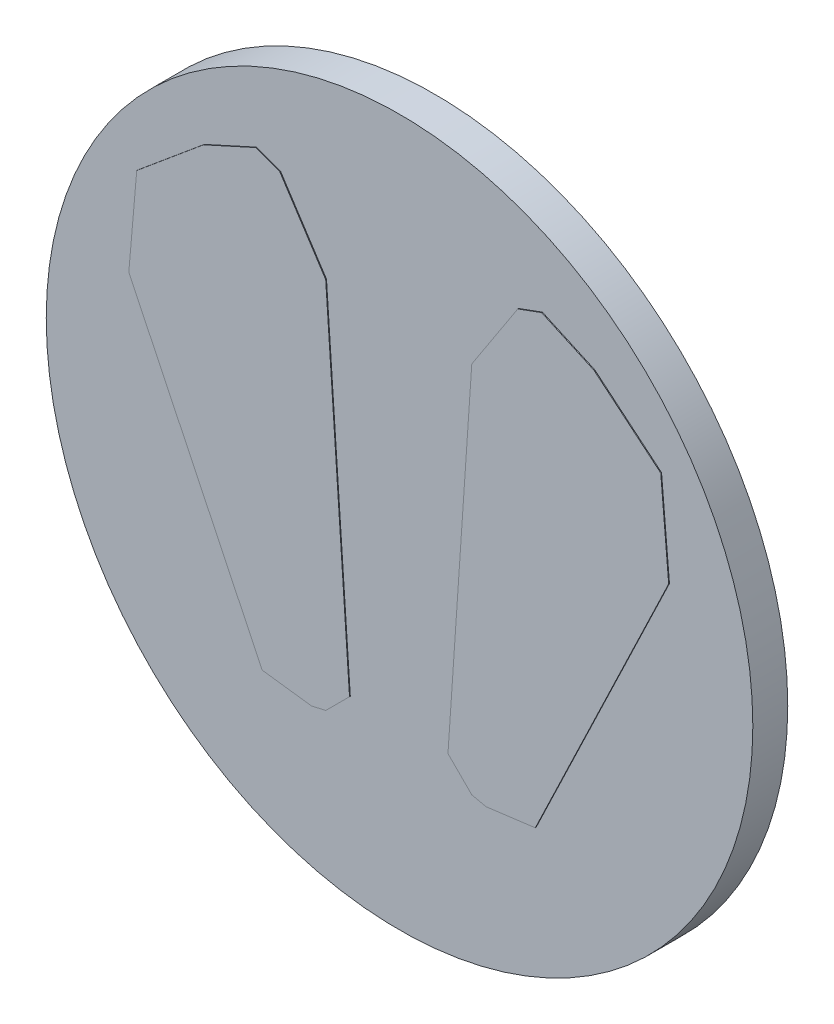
ISO-10303-21;
HEADER;
FILE_DESCRIPTION(('STEP AP214'),'2;1');
FILE_NAME('part.step','',(''),(''),'','','');
FILE_SCHEMA(('AUTOMOTIVE_DESIGN { 1 0 10303 214 1 1 1 1 }'));
ENDSEC;
DATA;
#1=APPLICATION_CONTEXT('core data for automotive mechanical design processes');
#2=APPLICATION_PROTOCOL_DEFINITION('international standard','automotive_design',2000,#1);
#3=PRODUCT_CONTEXT('',#1,'mechanical');
#4=PRODUCT('Part','Part','',(#3));
#5=PRODUCT_RELATED_PRODUCT_CATEGORY('part','',(#4));
#6=PRODUCT_DEFINITION_FORMATION('','',#4);
#7=PRODUCT_DEFINITION_CONTEXT('part definition',#1,'design');
#8=PRODUCT_DEFINITION('design','',#6,#7);
#9=PRODUCT_DEFINITION_SHAPE('','',#8);
#10=(LENGTH_UNIT() NAMED_UNIT(*) SI_UNIT(.MILLI.,.METRE.));
#11=(NAMED_UNIT(*) PLANE_ANGLE_UNIT() SI_UNIT($,.RADIAN.));
#12=(NAMED_UNIT(*) SI_UNIT($,.STERADIAN.) SOLID_ANGLE_UNIT());
#13=UNCERTAINTY_MEASURE_WITH_UNIT(LENGTH_MEASURE(1.E-05),#10,'distance_accuracy_value','');
#14=(GEOMETRIC_REPRESENTATION_CONTEXT(3) GLOBAL_UNCERTAINTY_ASSIGNED_CONTEXT((#13)) GLOBAL_UNIT_ASSIGNED_CONTEXT((#10,
#11,#12)) REPRESENTATION_CONTEXT('',''));
#15=CARTESIAN_POINT('',(0.,0.,0.));
#16=DIRECTION('',(0.,0.,1.));
#17=DIRECTION('',(1.,0.,0.));
#18=AXIS2_PLACEMENT_3D('',#15,#16,#17);
#19=CARTESIAN_POINT('',(0.,0.,22.));
#20=DIRECTION('',(0.,0.,1.));
#21=DIRECTION('',(1.,0.,0.));
#22=AXIS2_PLACEMENT_3D('',#19,#20,#21);
#23=PLANE('',#22);
#24=CARTESIAN_POINT('',(0.,0.,22.));
#25=DIRECTION('',(0.,0.,1.));
#26=DIRECTION('',(1.,0.,0.));
#27=AXIS2_PLACEMENT_3D('',#24,#25,#26);
#28=CIRCLE('',#27,222.5);
#29=CARTESIAN_POINT('',(222.5,0.,22.));
#30=VERTEX_POINT('',#29);
#31=EDGE_CURVE('E11',#30,#30,#28,.T.);
#32=ORIENTED_EDGE('',*,*,#31,.T.);
#33=EDGE_LOOP('',(#32));
#34=FACE_BOUND('',#33,.T.);
#35=DIRECTION('',(0.0680238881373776,0.99768369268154,0.));
#36=VECTOR('',#35,1.);
#37=CARTESIAN_POINT('',(5.12562076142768,-489.990895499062,22.));
#38=LINE('',#37,#36);
#39=CARTESIAN_POINT('',(31.,-110.5,22.));
#40=VERTEX_POINT('',#39);
#41=CARTESIAN_POINT('',(46.,109.5,22.));
#42=VERTEX_POINT('',#41);
#43=EDGE_CURVE('E197',#40,#42,#38,.T.);
#44=ORIENTED_EDGE('',*,*,#43,.T.);
#45=DIRECTION('',(-0.545980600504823,-0.837797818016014,0.));
#46=VECTOR('',#45,1.);
#47=CARTESIAN_POINT('',(-241.772442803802,-332.081851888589,22.));
#48=LINE('',#47,#46);
#49=CARTESIAN_POINT('',(75.0000000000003,154.,22.));
#50=VERTEX_POINT('',#49);
#51=EDGE_CURVE('E210',#50,#42,#48,.T.);
#52=ORIENTED_EDGE('',*,*,#51,.F.);
#53=DIRECTION('',(-0.938876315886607,-0.344254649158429,0.));
#54=VECTOR('',#53,1.);
#55=CARTESIAN_POINT('',(-199.144631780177,53.4803016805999,22.));
#56=LINE('',#55,#54);
#57=CARTESIAN_POINT('',(90.0000000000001,159.5,22.));
#58=VERTEX_POINT('',#57);
#59=EDGE_CURVE('E248',#58,#50,#56,.T.);
#60=ORIENTED_EDGE('',*,*,#59,.F.);
#61=DIRECTION('',(-0.910366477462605,0.413802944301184,0.));
#62=VECTOR('',#61,1.);
#63=CARTESIAN_POINT('',(259.950535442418,82.2497566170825,22.));
#64=LINE('',#63,#62);
#65=CARTESIAN_POINT('',(123.,144.5,22.));
#66=VERTEX_POINT('',#65);
#67=EDGE_CURVE('E246',#66,#58,#64,.T.);
#68=ORIENTED_EDGE('',*,*,#67,.F.);
#69=DIRECTION('',(-0.768221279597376,0.64018439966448,0.));
#70=VECTOR('',#69,1.);
#71=CARTESIAN_POINT('',(362.282666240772,-54.9022218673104,22.));
#72=LINE('',#71,#70);
#73=CARTESIAN_POINT('',(165.,109.5,22.));
#74=VERTEX_POINT('',#73);
#75=EDGE_CURVE('E244',#74,#66,#72,.T.);
#76=ORIENTED_EDGE('',*,*,#75,.F.);
#77=DIRECTION('',(-0.0858883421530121,0.996304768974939,0.));
#78=VECTOR('',#77,1.);
#79=CARTESIAN_POINT('',(215.051936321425,-471.102461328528,22.));
#80=LINE('',#79,#78);
#81=CARTESIAN_POINT('',(170.,51.5000000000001,22.));
#82=VERTEX_POINT('',#81);
#83=EDGE_CURVE('E242',#82,#74,#80,.T.);
#84=ORIENTED_EDGE('',*,*,#83,.F.);
#85=DIRECTION('',(0.432731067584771,0.901523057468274,0.));
#86=VECTOR('',#85,1.);
#87=CARTESIAN_POINT('',(-72.9420369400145,-454.62924362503,22.));
#88=LINE('',#87,#86);
#89=CARTESIAN_POINT('',(86.0000000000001,-123.5,22.));
#90=VERTEX_POINT('',#89);
#91=EDGE_CURVE('E240',#90,#82,#88,.T.);
#92=ORIENTED_EDGE('',*,*,#91,.F.);
#93=DIRECTION('',(-0.991777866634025,-0.127971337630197,0.));
#94=VECTOR('',#93,1.);
#95=CARTESIAN_POINT('',(-45.0619613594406,-140.411220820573,22.));
#96=LINE('',#95,#94);
#97=CARTESIAN_POINT('',(55.,-127.5,22.));
#98=VERTEX_POINT('',#97);
#99=EDGE_CURVE('E237',#90,#98,#96,.T.);
#100=ORIENTED_EDGE('',*,*,#99,.T.);
#101=DIRECTION('',(-0.976187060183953,0.216930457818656,0.));
#102=VECTOR('',#101,1.);
#103=CARTESIAN_POINT('',(79.2770068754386,-132.894890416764,22.));
#104=LINE('',#103,#102);
#105=CARTESIAN_POINT('',(46.,-125.5,22.));
#106=VERTEX_POINT('',#105);
#107=EDGE_CURVE('E234',#98,#106,#104,.T.);
#108=ORIENTED_EDGE('',*,*,#107,.T.);
#109=DIRECTION('',(-0.707106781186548,0.707106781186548,0.));
#110=VECTOR('',#109,1.);
#111=CARTESIAN_POINT('',(205.070710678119,-284.570710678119,22.));
#112=LINE('',#111,#110);
#113=EDGE_CURVE('E200',#106,#40,#112,.T.);
#114=ORIENTED_EDGE('',*,*,#113,.T.);
#115=EDGE_LOOP('',(#44,#52,#60,#68,#76,#84,#92,#100,#108,#114));
#116=FACE_BOUND('',#115,.T.);
#117=DIRECTION('',(-0.0680238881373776,0.99768369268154,0.));
#118=VECTOR('',#117,1.);
#119=CARTESIAN_POINT('',(-5.12562076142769,-489.990895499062,22.));
#120=LINE('',#119,#118);
#121=CARTESIAN_POINT('',(-31.0000000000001,-110.5,22.));
#122=VERTEX_POINT('',#121);
#123=CARTESIAN_POINT('',(-46.,109.5,22.));
#124=VERTEX_POINT('',#123);
#125=EDGE_CURVE('E530',#122,#124,#120,.T.);
#126=ORIENTED_EDGE('',*,*,#125,.F.);
#127=DIRECTION('',(0.707106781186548,0.707106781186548,0.));
#128=VECTOR('',#127,1.);
#129=CARTESIAN_POINT('',(-205.070710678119,-284.570710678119,22.));
#130=LINE('',#129,#128);
#131=CARTESIAN_POINT('',(-46.,-125.5,22.));
#132=VERTEX_POINT('',#131);
#133=EDGE_CURVE('E195',#132,#122,#130,.T.);
#134=ORIENTED_EDGE('',*,*,#133,.F.);
#135=DIRECTION('',(0.976187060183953,0.216930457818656,0.));
#136=VECTOR('',#135,1.);
#137=CARTESIAN_POINT('',(-79.2770068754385,-132.894890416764,22.));
#138=LINE('',#137,#136);
#139=CARTESIAN_POINT('',(-55.,-127.5,22.));
#140=VERTEX_POINT('',#139);
#141=EDGE_CURVE('E191',#140,#132,#138,.T.);
#142=ORIENTED_EDGE('',*,*,#141,.F.);
#143=DIRECTION('',(0.991777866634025,-0.127971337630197,0.));
#144=VECTOR('',#143,1.);
#145=CARTESIAN_POINT('',(45.0619613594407,-140.411220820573,22.));
#146=LINE('',#145,#144);
#147=CARTESIAN_POINT('',(-86.,-123.5,22.));
#148=VERTEX_POINT('',#147);
#149=EDGE_CURVE('E526',#148,#140,#146,.T.);
#150=ORIENTED_EDGE('',*,*,#149,.F.);
#151=DIRECTION('',(-0.432731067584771,0.901523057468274,0.));
#152=VECTOR('',#151,1.);
#153=CARTESIAN_POINT('',(72.9420369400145,-454.62924362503,22.));
#154=LINE('',#153,#152);
#155=CARTESIAN_POINT('',(-170.,51.5,22.));
#156=VERTEX_POINT('',#155);
#157=EDGE_CURVE('E550',#148,#156,#154,.T.);
#158=ORIENTED_EDGE('',*,*,#157,.T.);
#159=DIRECTION('',(0.0858883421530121,0.996304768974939,0.));
#160=VECTOR('',#159,1.);
#161=CARTESIAN_POINT('',(-215.051936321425,-471.102461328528,22.));
#162=LINE('',#161,#160);
#163=CARTESIAN_POINT('',(-165.,109.5,22.));
#164=VERTEX_POINT('',#163);
#165=EDGE_CURVE('E547',#156,#164,#162,.T.);
#166=ORIENTED_EDGE('',*,*,#165,.T.);
#167=DIRECTION('',(0.768221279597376,0.64018439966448,0.));
#168=VECTOR('',#167,1.);
#169=CARTESIAN_POINT('',(-362.282666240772,-54.9022218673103,22.));
#170=LINE('',#169,#168);
#171=CARTESIAN_POINT('',(-123.,144.5,22.));
#172=VERTEX_POINT('',#171);
#173=EDGE_CURVE('E544',#164,#172,#170,.T.);
#174=ORIENTED_EDGE('',*,*,#173,.T.);
#175=DIRECTION('',(0.910366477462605,0.413802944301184,0.));
#176=VECTOR('',#175,1.);
#177=CARTESIAN_POINT('',(-259.950535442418,82.2497566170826,22.));
#178=LINE('',#177,#176);
#179=CARTESIAN_POINT('',(-90.0000000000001,159.5,22.));
#180=VERTEX_POINT('',#179);
#181=EDGE_CURVE('E541',#172,#180,#178,.T.);
#182=ORIENTED_EDGE('',*,*,#181,.T.);
#183=DIRECTION('',(0.938876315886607,-0.344254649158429,0.));
#184=VECTOR('',#183,1.);
#185=CARTESIAN_POINT('',(199.144631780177,53.4803016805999,22.));
#186=LINE('',#185,#184);
#187=CARTESIAN_POINT('',(-75.0000000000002,154.,22.));
#188=VERTEX_POINT('',#187);
#189=EDGE_CURVE('E538',#180,#188,#186,.T.);
#190=ORIENTED_EDGE('',*,*,#189,.T.);
#191=DIRECTION('',(0.545980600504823,-0.837797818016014,0.));
#192=VECTOR('',#191,1.);
#193=CARTESIAN_POINT('',(241.772442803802,-332.08185188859,22.));
#194=LINE('',#193,#192);
#195=EDGE_CURVE('E532',#188,#124,#194,.T.);
#196=ORIENTED_EDGE('',*,*,#195,.T.);
#197=EDGE_LOOP('',(#126,#134,#142,#150,#158,#166,#174,#182,#190,#196));
#198=FACE_BOUND('',#197,.T.);
#199=ADVANCED_FACE('F32',(#34,#116,#198),#23,.T.);
#200=CARTESIAN_POINT('',(0.,0.,22.));
#201=DIRECTION('',(0.,0.,-1.));
#202=DIRECTION('',(-1.,0.,0.));
#203=AXIS2_PLACEMENT_3D('',#200,#201,#202);
#204=CYLINDRICAL_SURFACE('',#203,222.5);
#205=ORIENTED_EDGE('',*,*,#31,.F.);
#206=EDGE_LOOP('',(#205));
#207=FACE_BOUND('',#206,.T.);
#208=CARTESIAN_POINT('',(0.,0.,0.));
#209=DIRECTION('',(0.,0.,1.));
#210=DIRECTION('',(1.,0.,0.));
#211=AXIS2_PLACEMENT_3D('',#208,#209,#210);
#212=CIRCLE('',#211,222.5);
#213=CARTESIAN_POINT('',(222.5,0.,0.));
#214=VERTEX_POINT('',#213);
#215=EDGE_CURVE('E36',#214,#214,#212,.T.);
#216=ORIENTED_EDGE('',*,*,#215,.T.);
#217=EDGE_LOOP('',(#216));
#218=FACE_BOUND('',#217,.T.);
#219=ADVANCED_FACE('F34',(#207,#218),#204,.T.);
#220=CARTESIAN_POINT('',(0.,0.,0.));
#221=DIRECTION('',(0.,0.,1.));
#222=DIRECTION('',(1.,0.,0.));
#223=AXIS2_PLACEMENT_3D('',#220,#221,#222);
#224=PLANE('',#223);
#225=ORIENTED_EDGE('',*,*,#215,.F.);
#226=EDGE_LOOP('',(#225));
#227=FACE_BOUND('',#226,.T.);
#228=ADVANCED_FACE('F279',(#227),#224,.F.);
#229=CARTESIAN_POINT('',(5.12562076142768,-489.990895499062,22.5));
#230=DIRECTION('',(-0.99768369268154,0.0680238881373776,0.));
#231=DIRECTION('',(-0.0680238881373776,-0.99768369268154,0.));
#232=AXIS2_PLACEMENT_3D('',#229,#230,#231);
#233=PLANE('',#232);
#234=ORIENTED_EDGE('',*,*,#43,.F.);
#235=DIRECTION('',(0.,0.,-1.));
#236=VECTOR('',#235,1.);
#237=CARTESIAN_POINT('',(31.,-110.5,22.5));
#238=LINE('',#237,#236);
#239=CARTESIAN_POINT('',(31.,-110.5,22.5));
#240=VERTEX_POINT('',#239);
#241=EDGE_CURVE('E271',#240,#40,#238,.T.);
#242=ORIENTED_EDGE('',*,*,#241,.F.);
#243=DIRECTION('',(0.0680238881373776,0.99768369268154,0.));
#244=VECTOR('',#243,1.);
#245=CARTESIAN_POINT('',(5.12562076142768,-489.990895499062,22.5));
#246=LINE('',#245,#244);
#247=CARTESIAN_POINT('',(46.,109.5,22.5));
#248=VERTEX_POINT('',#247);
#249=EDGE_CURVE('E206',#240,#248,#246,.T.);
#250=ORIENTED_EDGE('',*,*,#249,.T.);
#251=DIRECTION('',(0.,0.,-1.));
#252=VECTOR('',#251,1.);
#253=CARTESIAN_POINT('',(46.,109.5,22.5));
#254=LINE('',#253,#252);
#255=EDGE_CURVE('E230',#248,#42,#254,.T.);
#256=ORIENTED_EDGE('',*,*,#255,.T.);
#257=EDGE_LOOP('',(#234,#242,#250,#256));
#258=FACE_BOUND('',#257,.T.);
#259=ADVANCED_FACE('F281',(#258),#233,.T.);
#260=CARTESIAN_POINT('',(205.070710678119,-284.570710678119,22.5));
#261=DIRECTION('',(-0.707106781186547,-0.707106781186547,0.));
#262=DIRECTION('',(0.707106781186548,-0.707106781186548,0.));
#263=AXIS2_PLACEMENT_3D('',#260,#261,#262);
#264=PLANE('',#263);
#265=ORIENTED_EDGE('',*,*,#113,.F.);
#266=DIRECTION('',(0.,0.,-1.));
#267=VECTOR('',#266,1.);
#268=CARTESIAN_POINT('',(46.,-125.5,22.5));
#269=LINE('',#268,#267);
#270=CARTESIAN_POINT('',(46.,-125.5,22.5));
#271=VERTEX_POINT('',#270);
#272=EDGE_CURVE('E269',#271,#106,#269,.T.);
#273=ORIENTED_EDGE('',*,*,#272,.F.);
#274=DIRECTION('',(-0.707106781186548,0.707106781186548,0.));
#275=VECTOR('',#274,1.);
#276=CARTESIAN_POINT('',(205.070710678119,-284.570710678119,22.5));
#277=LINE('',#276,#275);
#278=EDGE_CURVE('E209',#271,#240,#277,.T.);
#279=ORIENTED_EDGE('',*,*,#278,.T.);
#280=ORIENTED_EDGE('',*,*,#241,.T.);
#281=EDGE_LOOP('',(#265,#273,#279,#280));
#282=FACE_BOUND('',#281,.T.);
#283=ADVANCED_FACE('F286',(#282),#264,.T.);
#284=CARTESIAN_POINT('',(79.2770068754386,-132.894890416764,22.5));
#285=DIRECTION('',(-0.216930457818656,-0.976187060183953,0.));
#286=DIRECTION('',(0.976187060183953,-0.216930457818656,0.));
#287=AXIS2_PLACEMENT_3D('',#284,#285,#286);
#288=PLANE('',#287);
#289=ORIENTED_EDGE('',*,*,#107,.F.);
#290=DIRECTION('',(0.,0.,-1.));
#291=VECTOR('',#290,1.);
#292=CARTESIAN_POINT('',(55.,-127.5,22.5));
#293=LINE('',#292,#291);
#294=CARTESIAN_POINT('',(55.,-127.5,22.5));
#295=VERTEX_POINT('',#294);
#296=EDGE_CURVE('E267',#295,#98,#293,.T.);
#297=ORIENTED_EDGE('',*,*,#296,.F.);
#298=DIRECTION('',(-0.976187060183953,0.216930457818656,0.));
#299=VECTOR('',#298,1.);
#300=CARTESIAN_POINT('',(79.2770068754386,-132.894890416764,22.5));
#301=LINE('',#300,#299);
#302=EDGE_CURVE('E213',#295,#271,#301,.T.);
#303=ORIENTED_EDGE('',*,*,#302,.T.);
#304=ORIENTED_EDGE('',*,*,#272,.T.);
#305=EDGE_LOOP('',(#289,#297,#303,#304));
#306=FACE_BOUND('',#305,.T.);
#307=ADVANCED_FACE('F299',(#306),#288,.T.);
#308=CARTESIAN_POINT('',(-45.0619613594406,-140.411220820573,22.5));
#309=DIRECTION('',(0.127971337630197,-0.991777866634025,0.));
#310=DIRECTION('',(0.991777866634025,0.127971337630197,0.));
#311=AXIS2_PLACEMENT_3D('',#308,#309,#310);
#312=PLANE('',#311);
#313=ORIENTED_EDGE('',*,*,#99,.F.);
#314=DIRECTION('',(0.,0.,-1.));
#315=VECTOR('',#314,1.);
#316=CARTESIAN_POINT('',(86.0000000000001,-123.5,22.5));
#317=LINE('',#316,#315);
#318=CARTESIAN_POINT('',(86.0000000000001,-123.5,22.5));
#319=VERTEX_POINT('',#318);
#320=EDGE_CURVE('E265',#319,#90,#317,.T.);
#321=ORIENTED_EDGE('',*,*,#320,.F.);
#322=DIRECTION('',(-0.991777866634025,-0.127971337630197,0.));
#323=VECTOR('',#322,1.);
#324=CARTESIAN_POINT('',(-45.0619613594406,-140.411220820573,22.5));
#325=LINE('',#324,#323);
#326=EDGE_CURVE('E216',#319,#295,#325,.T.);
#327=ORIENTED_EDGE('',*,*,#326,.T.);
#328=ORIENTED_EDGE('',*,*,#296,.T.);
#329=EDGE_LOOP('',(#313,#321,#327,#328));
#330=FACE_BOUND('',#329,.T.);
#331=ADVANCED_FACE('F302',(#330),#312,.T.);
#332=CARTESIAN_POINT('',(-72.9420369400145,-454.62924362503,22.5));
#333=DIRECTION('',(-0.901523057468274,0.432731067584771,0.));
#334=DIRECTION('',(-0.432731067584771,-0.901523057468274,0.));
#335=AXIS2_PLACEMENT_3D('',#332,#333,#334);
#336=PLANE('',#335);
#337=ORIENTED_EDGE('',*,*,#91,.T.);
#338=DIRECTION('',(0.,0.,-1.));
#339=VECTOR('',#338,1.);
#340=CARTESIAN_POINT('',(170.,51.5000000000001,22.5));
#341=LINE('',#340,#339);
#342=CARTESIAN_POINT('',(170.,51.5000000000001,22.5));
#343=VERTEX_POINT('',#342);
#344=EDGE_CURVE('E262',#343,#82,#341,.T.);
#345=ORIENTED_EDGE('',*,*,#344,.F.);
#346=DIRECTION('',(0.432731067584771,0.901523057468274,0.));
#347=VECTOR('',#346,1.);
#348=CARTESIAN_POINT('',(-72.9420369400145,-454.62924362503,22.5));
#349=LINE('',#348,#347);
#350=EDGE_CURVE('E219',#319,#343,#349,.T.);
#351=ORIENTED_EDGE('',*,*,#350,.F.);
#352=ORIENTED_EDGE('',*,*,#320,.T.);
#353=EDGE_LOOP('',(#337,#345,#351,#352));
#354=FACE_BOUND('',#353,.T.);
#355=ADVANCED_FACE('F306',(#354),#336,.F.);
#356=CARTESIAN_POINT('',(215.051936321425,-471.102461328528,22.5));
#357=DIRECTION('',(-0.996304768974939,-0.0858883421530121,0.));
#358=DIRECTION('',(0.0858883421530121,-0.996304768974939,0.));
#359=AXIS2_PLACEMENT_3D('',#356,#357,#358);
#360=PLANE('',#359);
#361=ORIENTED_EDGE('',*,*,#83,.T.);
#362=DIRECTION('',(0.,0.,-1.));
#363=VECTOR('',#362,1.);
#364=CARTESIAN_POINT('',(165.,109.5,22.5));
#365=LINE('',#364,#363);
#366=CARTESIAN_POINT('',(165.,109.5,22.5));
#367=VERTEX_POINT('',#366);
#368=EDGE_CURVE('E259',#367,#74,#365,.T.);
#369=ORIENTED_EDGE('',*,*,#368,.F.);
#370=DIRECTION('',(-0.0858883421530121,0.996304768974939,0.));
#371=VECTOR('',#370,1.);
#372=CARTESIAN_POINT('',(215.051936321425,-471.102461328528,22.5));
#373=LINE('',#372,#371);
#374=EDGE_CURVE('E221',#343,#367,#373,.T.);
#375=ORIENTED_EDGE('',*,*,#374,.F.);
#376=ORIENTED_EDGE('',*,*,#344,.T.);
#377=EDGE_LOOP('',(#361,#369,#375,#376));
#378=FACE_BOUND('',#377,.T.);
#379=ADVANCED_FACE('F310',(#378),#360,.F.);
#380=CARTESIAN_POINT('',(362.282666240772,-54.9022218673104,22.5));
#381=DIRECTION('',(-0.64018439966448,-0.768221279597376,0.));
#382=DIRECTION('',(0.768221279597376,-0.64018439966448,0.));
#383=AXIS2_PLACEMENT_3D('',#380,#381,#382);
#384=PLANE('',#383);
#385=ORIENTED_EDGE('',*,*,#75,.T.);
#386=DIRECTION('',(0.,0.,-1.));
#387=VECTOR('',#386,1.);
#388=CARTESIAN_POINT('',(123.,144.5,22.5));
#389=LINE('',#388,#387);
#390=CARTESIAN_POINT('',(123.,144.5,22.5));
#391=VERTEX_POINT('',#390);
#392=EDGE_CURVE('E256',#391,#66,#389,.T.);
#393=ORIENTED_EDGE('',*,*,#392,.F.);
#394=DIRECTION('',(-0.768221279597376,0.64018439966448,0.));
#395=VECTOR('',#394,1.);
#396=CARTESIAN_POINT('',(362.282666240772,-54.9022218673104,22.5));
#397=LINE('',#396,#395);
#398=EDGE_CURVE('E223',#367,#391,#397,.T.);
#399=ORIENTED_EDGE('',*,*,#398,.F.);
#400=ORIENTED_EDGE('',*,*,#368,.T.);
#401=EDGE_LOOP('',(#385,#393,#399,#400));
#402=FACE_BOUND('',#401,.T.);
#403=ADVANCED_FACE('F314',(#402),#384,.F.);
#404=CARTESIAN_POINT('',(259.950535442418,82.2497566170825,22.5));
#405=DIRECTION('',(-0.413802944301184,-0.910366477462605,0.));
#406=DIRECTION('',(0.910366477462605,-0.413802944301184,0.));
#407=AXIS2_PLACEMENT_3D('',#404,#405,#406);
#408=PLANE('',#407);
#409=ORIENTED_EDGE('',*,*,#67,.T.);
#410=DIRECTION('',(0.,0.,-1.));
#411=VECTOR('',#410,1.);
#412=CARTESIAN_POINT('',(90.0000000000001,159.5,22.5));
#413=LINE('',#412,#411);
#414=CARTESIAN_POINT('',(90.0000000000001,159.5,22.5));
#415=VERTEX_POINT('',#414);
#416=EDGE_CURVE('E253',#415,#58,#413,.T.);
#417=ORIENTED_EDGE('',*,*,#416,.F.);
#418=DIRECTION('',(-0.910366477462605,0.413802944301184,0.));
#419=VECTOR('',#418,1.);
#420=CARTESIAN_POINT('',(259.950535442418,82.2497566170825,22.5));
#421=LINE('',#420,#419);
#422=EDGE_CURVE('E225',#391,#415,#421,.T.);
#423=ORIENTED_EDGE('',*,*,#422,.F.);
#424=ORIENTED_EDGE('',*,*,#392,.T.);
#425=EDGE_LOOP('',(#409,#417,#423,#424));
#426=FACE_BOUND('',#425,.T.);
#427=ADVANCED_FACE('F318',(#426),#408,.F.);
#428=CARTESIAN_POINT('',(-199.144631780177,53.4803016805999,22.5));
#429=DIRECTION('',(0.344254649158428,-0.938876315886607,0.));
#430=DIRECTION('',(0.938876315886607,0.344254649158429,0.));
#431=AXIS2_PLACEMENT_3D('',#428,#429,#430);
#432=PLANE('',#431);
#433=ORIENTED_EDGE('',*,*,#59,.T.);
#434=DIRECTION('',(0.,0.,-1.));
#435=VECTOR('',#434,1.);
#436=CARTESIAN_POINT('',(75.0000000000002,154.,22.5));
#437=LINE('',#436,#435);
#438=CARTESIAN_POINT('',(75.0000000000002,154.,22.5));
#439=VERTEX_POINT('',#438);
#440=EDGE_CURVE('E55',#439,#50,#437,.T.);
#441=ORIENTED_EDGE('',*,*,#440,.F.);
#442=DIRECTION('',(-0.938876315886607,-0.344254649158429,0.));
#443=VECTOR('',#442,1.);
#444=CARTESIAN_POINT('',(-199.144631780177,53.4803016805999,22.5));
#445=LINE('',#444,#443);
#446=EDGE_CURVE('E227',#415,#439,#445,.T.);
#447=ORIENTED_EDGE('',*,*,#446,.F.);
#448=ORIENTED_EDGE('',*,*,#416,.T.);
#449=EDGE_LOOP('',(#433,#441,#447,#448));
#450=FACE_BOUND('',#449,.T.);
#451=ADVANCED_FACE('F322',(#450),#432,.F.);
#452=CARTESIAN_POINT('',(-241.772442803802,-332.081851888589,22.5));
#453=DIRECTION('',(0.837797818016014,-0.545980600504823,0.));
#454=DIRECTION('',(0.545980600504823,0.837797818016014,0.));
#455=AXIS2_PLACEMENT_3D('',#452,#453,#454);
#456=PLANE('',#455);
#457=ORIENTED_EDGE('',*,*,#51,.T.);
#458=ORIENTED_EDGE('',*,*,#255,.F.);
#459=DIRECTION('',(-0.545980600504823,-0.837797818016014,0.));
#460=VECTOR('',#459,1.);
#461=CARTESIAN_POINT('',(-241.772442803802,-332.081851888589,22.5));
#462=LINE('',#461,#460);
#463=EDGE_CURVE('E229',#439,#248,#462,.T.);
#464=ORIENTED_EDGE('',*,*,#463,.F.);
#465=ORIENTED_EDGE('',*,*,#440,.T.);
#466=EDGE_LOOP('',(#457,#458,#464,#465));
#467=FACE_BOUND('',#466,.T.);
#468=ADVANCED_FACE('F326',(#467),#456,.F.);
#469=CARTESIAN_POINT('',(0.,-489.641421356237,22.5));
#470=DIRECTION('',(0.,0.,1.));
#471=DIRECTION('',(1.,0.,0.));
#472=AXIS2_PLACEMENT_3D('',#469,#470,#471);
#473=PLANE('',#472);
#474=ORIENTED_EDGE('',*,*,#249,.F.);
#475=ORIENTED_EDGE('',*,*,#278,.F.);
#476=ORIENTED_EDGE('',*,*,#302,.F.);
#477=ORIENTED_EDGE('',*,*,#326,.F.);
#478=ORIENTED_EDGE('',*,*,#350,.T.);
#479=ORIENTED_EDGE('',*,*,#374,.T.);
#480=ORIENTED_EDGE('',*,*,#398,.T.);
#481=ORIENTED_EDGE('',*,*,#422,.T.);
#482=ORIENTED_EDGE('',*,*,#446,.T.);
#483=ORIENTED_EDGE('',*,*,#463,.T.);
#484=EDGE_LOOP('',(#474,#475,#476,#477,#478,#479,#480,#481,#482,#483));
#485=FACE_BOUND('',#484,.T.);
#486=ADVANCED_FACE('F330',(#485),#473,.T.);
#487=CARTESIAN_POINT('',(-205.070710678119,-284.570710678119,22.5));
#488=DIRECTION('',(-0.707106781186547,0.707106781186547,0.));
#489=DIRECTION('',(-0.707106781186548,-0.707106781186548,0.));
#490=AXIS2_PLACEMENT_3D('',#487,#488,#489);
#491=PLANE('',#490);
#492=ORIENTED_EDGE('',*,*,#133,.T.);
#493=DIRECTION('',(0.,0.,-1.));
#494=VECTOR('',#493,1.);
#495=CARTESIAN_POINT('',(-31.0000000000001,-110.5,22.5));
#496=LINE('',#495,#494);
#497=CARTESIAN_POINT('',(-31.0000000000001,-110.5,22.5));
#498=VERTEX_POINT('',#497);
#499=EDGE_CURVE('E176',#498,#122,#496,.T.);
#500=ORIENTED_EDGE('',*,*,#499,.F.);
#501=DIRECTION('',(0.707106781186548,0.707106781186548,0.));
#502=VECTOR('',#501,1.);
#503=CARTESIAN_POINT('',(-205.070710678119,-284.570710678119,22.5));
#504=LINE('',#503,#502);
#505=CARTESIAN_POINT('',(-46.,-125.5,22.5));
#506=VERTEX_POINT('',#505);
#507=EDGE_CURVE('E183',#506,#498,#504,.T.);
#508=ORIENTED_EDGE('',*,*,#507,.F.);
#509=DIRECTION('',(0.,0.,-1.));
#510=VECTOR('',#509,1.);
#511=CARTESIAN_POINT('',(-46.,-125.5,22.5));
#512=LINE('',#511,#510);
#513=EDGE_CURVE('E523',#506,#132,#512,.T.);
#514=ORIENTED_EDGE('',*,*,#513,.T.);
#515=EDGE_LOOP('',(#492,#500,#508,#514));
#516=FACE_BOUND('',#515,.T.);
#517=ADVANCED_FACE('F193',(#516),#491,.F.);
#518=CARTESIAN_POINT('',(-5.12562076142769,-489.990895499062,22.5));
#519=DIRECTION('',(-0.99768369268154,-0.0680238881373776,0.));
#520=DIRECTION('',(0.0680238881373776,-0.99768369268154,0.));
#521=AXIS2_PLACEMENT_3D('',#518,#519,#520);
#522=PLANE('',#521);
#523=ORIENTED_EDGE('',*,*,#125,.T.);
#524=DIRECTION('',(0.,0.,-1.));
#525=VECTOR('',#524,1.);
#526=CARTESIAN_POINT('',(-46.,109.5,22.5));
#527=LINE('',#526,#525);
#528=CARTESIAN_POINT('',(-46.,109.5,22.5));
#529=VERTEX_POINT('',#528);
#530=EDGE_CURVE('E178',#529,#124,#527,.T.);
#531=ORIENTED_EDGE('',*,*,#530,.F.);
#532=DIRECTION('',(-0.0680238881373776,0.99768369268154,0.));
#533=VECTOR('',#532,1.);
#534=CARTESIAN_POINT('',(-5.12562076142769,-489.990895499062,22.5));
#535=LINE('',#534,#533);
#536=EDGE_CURVE('E171',#498,#529,#535,.T.);
#537=ORIENTED_EDGE('',*,*,#536,.F.);
#538=ORIENTED_EDGE('',*,*,#499,.T.);
#539=EDGE_LOOP('',(#523,#531,#537,#538));
#540=FACE_BOUND('',#539,.T.);
#541=ADVANCED_FACE('F174',(#540),#522,.F.);
#542=CARTESIAN_POINT('',(241.772442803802,-332.08185188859,22.5));
#543=DIRECTION('',(0.837797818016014,0.545980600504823,0.));
#544=DIRECTION('',(-0.545980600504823,0.837797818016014,0.));
#545=AXIS2_PLACEMENT_3D('',#542,#543,#544);
#546=PLANE('',#545);
#547=ORIENTED_EDGE('',*,*,#195,.F.);
#548=DIRECTION('',(0.,0.,-1.));
#549=VECTOR('',#548,1.);
#550=CARTESIAN_POINT('',(-75.0000000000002,154.,22.5));
#551=LINE('',#550,#549);
#552=CARTESIAN_POINT('',(-75.0000000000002,154.,22.5));
#553=VERTEX_POINT('',#552);
#554=EDGE_CURVE('E202',#553,#188,#551,.T.);
#555=ORIENTED_EDGE('',*,*,#554,.F.);
#556=DIRECTION('',(0.545980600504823,-0.837797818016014,0.));
#557=VECTOR('',#556,1.);
#558=CARTESIAN_POINT('',(241.772442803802,-332.08185188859,22.5));
#559=LINE('',#558,#557);
#560=EDGE_CURVE('E182',#553,#529,#559,.T.);
#561=ORIENTED_EDGE('',*,*,#560,.T.);
#562=ORIENTED_EDGE('',*,*,#530,.T.);
#563=EDGE_LOOP('',(#547,#555,#561,#562));
#564=FACE_BOUND('',#563,.T.);
#565=ADVANCED_FACE('F338',(#564),#546,.T.);
#566=CARTESIAN_POINT('',(199.144631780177,53.4803016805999,22.5));
#567=DIRECTION('',(0.344254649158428,0.938876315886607,0.));
#568=DIRECTION('',(-0.938876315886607,0.344254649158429,0.));
#569=AXIS2_PLACEMENT_3D('',#566,#567,#568);
#570=PLANE('',#569);
#571=ORIENTED_EDGE('',*,*,#189,.F.);
#572=DIRECTION('',(0.,0.,-1.));
#573=VECTOR('',#572,1.);
#574=CARTESIAN_POINT('',(-90.0000000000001,159.5,22.5));
#575=LINE('',#574,#573);
#576=CARTESIAN_POINT('',(-90.0000000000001,159.5,22.5));
#577=VERTEX_POINT('',#576);
#578=EDGE_CURVE('E563',#577,#180,#575,.T.);
#579=ORIENTED_EDGE('',*,*,#578,.F.);
#580=DIRECTION('',(0.938876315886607,-0.344254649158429,0.));
#581=VECTOR('',#580,1.);
#582=CARTESIAN_POINT('',(199.144631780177,53.4803016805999,22.5));
#583=LINE('',#582,#581);
#584=EDGE_CURVE('E568',#577,#553,#583,.T.);
#585=ORIENTED_EDGE('',*,*,#584,.T.);
#586=ORIENTED_EDGE('',*,*,#554,.T.);
#587=EDGE_LOOP('',(#571,#579,#585,#586));
#588=FACE_BOUND('',#587,.T.);
#589=ADVANCED_FACE('F341',(#588),#570,.T.);
#590=CARTESIAN_POINT('',(-259.950535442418,82.2497566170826,22.5));
#591=DIRECTION('',(-0.413802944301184,0.910366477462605,0.));
#592=DIRECTION('',(-0.910366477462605,-0.413802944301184,0.));
#593=AXIS2_PLACEMENT_3D('',#590,#591,#592);
#594=PLANE('',#593);
#595=ORIENTED_EDGE('',*,*,#181,.F.);
#596=DIRECTION('',(0.,0.,-1.));
#597=VECTOR('',#596,1.);
#598=CARTESIAN_POINT('',(-123.,144.5,22.5));
#599=LINE('',#598,#597);
#600=CARTESIAN_POINT('',(-123.,144.5,22.5));
#601=VERTEX_POINT('',#600);
#602=EDGE_CURVE('E561',#601,#172,#599,.T.);
#603=ORIENTED_EDGE('',*,*,#602,.F.);
#604=DIRECTION('',(0.910366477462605,0.413802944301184,0.));
#605=VECTOR('',#604,1.);
#606=CARTESIAN_POINT('',(-259.950535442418,82.2497566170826,22.5));
#607=LINE('',#606,#605);
#608=EDGE_CURVE('E573',#601,#577,#607,.T.);
#609=ORIENTED_EDGE('',*,*,#608,.T.);
#610=ORIENTED_EDGE('',*,*,#578,.T.);
#611=EDGE_LOOP('',(#595,#603,#609,#610));
#612=FACE_BOUND('',#611,.T.);
#613=ADVANCED_FACE('F345',(#612),#594,.T.);
#614=CARTESIAN_POINT('',(-362.282666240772,-54.9022218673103,22.5));
#615=DIRECTION('',(-0.64018439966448,0.768221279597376,0.));
#616=DIRECTION('',(-0.768221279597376,-0.64018439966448,0.));
#617=AXIS2_PLACEMENT_3D('',#614,#615,#616);
#618=PLANE('',#617);
#619=ORIENTED_EDGE('',*,*,#173,.F.);
#620=DIRECTION('',(0.,0.,-1.));
#621=VECTOR('',#620,1.);
#622=CARTESIAN_POINT('',(-165.,109.5,22.5));
#623=LINE('',#622,#621);
#624=CARTESIAN_POINT('',(-165.,109.5,22.5));
#625=VERTEX_POINT('',#624);
#626=EDGE_CURVE('E559',#625,#164,#623,.T.);
#627=ORIENTED_EDGE('',*,*,#626,.F.);
#628=DIRECTION('',(0.768221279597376,0.64018439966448,0.));
#629=VECTOR('',#628,1.);
#630=CARTESIAN_POINT('',(-362.282666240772,-54.9022218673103,22.5));
#631=LINE('',#630,#629);
#632=EDGE_CURVE('E577',#625,#601,#631,.T.);
#633=ORIENTED_EDGE('',*,*,#632,.T.);
#634=ORIENTED_EDGE('',*,*,#602,.T.);
#635=EDGE_LOOP('',(#619,#627,#633,#634));
#636=FACE_BOUND('',#635,.T.);
#637=ADVANCED_FACE('F349',(#636),#618,.T.);
#638=CARTESIAN_POINT('',(-215.051936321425,-471.102461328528,22.5));
#639=DIRECTION('',(-0.996304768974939,0.0858883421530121,0.));
#640=DIRECTION('',(-0.0858883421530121,-0.996304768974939,0.));
#641=AXIS2_PLACEMENT_3D('',#638,#639,#640);
#642=PLANE('',#641);
#643=ORIENTED_EDGE('',*,*,#165,.F.);
#644=DIRECTION('',(0.,0.,-1.));
#645=VECTOR('',#644,1.);
#646=CARTESIAN_POINT('',(-170.,51.5,22.5));
#647=LINE('',#646,#645);
#648=CARTESIAN_POINT('',(-170.,51.5,22.5));
#649=VERTEX_POINT('',#648);
#650=EDGE_CURVE('E557',#649,#156,#647,.T.);
#651=ORIENTED_EDGE('',*,*,#650,.F.);
#652=DIRECTION('',(0.0858883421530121,0.996304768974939,0.));
#653=VECTOR('',#652,1.);
#654=CARTESIAN_POINT('',(-215.051936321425,-471.102461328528,22.5));
#655=LINE('',#654,#653);
#656=EDGE_CURVE('E582',#649,#625,#655,.T.);
#657=ORIENTED_EDGE('',*,*,#656,.T.);
#658=ORIENTED_EDGE('',*,*,#626,.T.);
#659=EDGE_LOOP('',(#643,#651,#657,#658));
#660=FACE_BOUND('',#659,.T.);
#661=ADVANCED_FACE('F353',(#660),#642,.T.);
#662=CARTESIAN_POINT('',(72.9420369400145,-454.62924362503,22.5));
#663=DIRECTION('',(-0.901523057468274,-0.432731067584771,0.));
#664=DIRECTION('',(0.432731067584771,-0.901523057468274,0.));
#665=AXIS2_PLACEMENT_3D('',#662,#663,#664);
#666=PLANE('',#665);
#667=ORIENTED_EDGE('',*,*,#157,.F.);
#668=DIRECTION('',(0.,0.,-1.));
#669=VECTOR('',#668,1.);
#670=CARTESIAN_POINT('',(-86.,-123.5,22.5));
#671=LINE('',#670,#669);
#672=CARTESIAN_POINT('',(-86.,-123.5,22.5));
#673=VERTEX_POINT('',#672);
#674=EDGE_CURVE('E555',#673,#148,#671,.T.);
#675=ORIENTED_EDGE('',*,*,#674,.F.);
#676=DIRECTION('',(-0.432731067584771,0.901523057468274,0.));
#677=VECTOR('',#676,1.);
#678=CARTESIAN_POINT('',(72.9420369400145,-454.62924362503,22.5));
#679=LINE('',#678,#677);
#680=EDGE_CURVE('E585',#673,#649,#679,.T.);
#681=ORIENTED_EDGE('',*,*,#680,.T.);
#682=ORIENTED_EDGE('',*,*,#650,.T.);
#683=EDGE_LOOP('',(#667,#675,#681,#682));
#684=FACE_BOUND('',#683,.T.);
#685=ADVANCED_FACE('F357',(#684),#666,.T.);
#686=CARTESIAN_POINT('',(45.0619613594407,-140.411220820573,22.5));
#687=DIRECTION('',(0.127971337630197,0.991777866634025,0.));
#688=DIRECTION('',(-0.991777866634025,0.127971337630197,0.));
#689=AXIS2_PLACEMENT_3D('',#686,#687,#688);
#690=PLANE('',#689);
#691=ORIENTED_EDGE('',*,*,#149,.T.);
#692=DIRECTION('',(0.,0.,-1.));
#693=VECTOR('',#692,1.);
#694=CARTESIAN_POINT('',(-55.,-127.5,22.5));
#695=LINE('',#694,#693);
#696=CARTESIAN_POINT('',(-55.,-127.5,22.5));
#697=VERTEX_POINT('',#696);
#698=EDGE_CURVE('E47',#697,#140,#695,.T.);
#699=ORIENTED_EDGE('',*,*,#698,.F.);
#700=DIRECTION('',(0.991777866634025,-0.127971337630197,0.));
#701=VECTOR('',#700,1.);
#702=CARTESIAN_POINT('',(45.0619613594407,-140.411220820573,22.5));
#703=LINE('',#702,#701);
#704=EDGE_CURVE('E587',#673,#697,#703,.T.);
#705=ORIENTED_EDGE('',*,*,#704,.F.);
#706=ORIENTED_EDGE('',*,*,#674,.T.);
#707=EDGE_LOOP('',(#691,#699,#705,#706));
#708=FACE_BOUND('',#707,.T.);
#709=ADVANCED_FACE('F361',(#708),#690,.F.);
#710=CARTESIAN_POINT('',(-79.2770068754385,-132.894890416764,22.5));
#711=DIRECTION('',(-0.216930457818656,0.976187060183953,0.));
#712=DIRECTION('',(-0.976187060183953,-0.216930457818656,0.));
#713=AXIS2_PLACEMENT_3D('',#710,#711,#712);
#714=PLANE('',#713);
#715=ORIENTED_EDGE('',*,*,#141,.T.);
#716=ORIENTED_EDGE('',*,*,#513,.F.);
#717=DIRECTION('',(0.976187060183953,0.216930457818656,0.));
#718=VECTOR('',#717,1.);
#719=CARTESIAN_POINT('',(-79.2770068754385,-132.894890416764,22.5));
#720=LINE('',#719,#718);
#721=EDGE_CURVE('E187',#697,#506,#720,.T.);
#722=ORIENTED_EDGE('',*,*,#721,.F.);
#723=ORIENTED_EDGE('',*,*,#698,.T.);
#724=EDGE_LOOP('',(#715,#716,#722,#723));
#725=FACE_BOUND('',#724,.T.);
#726=ADVANCED_FACE('F365',(#725),#714,.F.);
#727=CARTESIAN_POINT('',(0.,-489.641421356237,22.5));
#728=DIRECTION('',(0.,0.,1.));
#729=DIRECTION('',(1.,0.,0.));
#730=AXIS2_PLACEMENT_3D('',#727,#728,#729);
#731=PLANE('',#730);
#732=ORIENTED_EDGE('',*,*,#507,.T.);
#733=ORIENTED_EDGE('',*,*,#536,.T.);
#734=ORIENTED_EDGE('',*,*,#560,.F.);
#735=ORIENTED_EDGE('',*,*,#584,.F.);
#736=ORIENTED_EDGE('',*,*,#608,.F.);
#737=ORIENTED_EDGE('',*,*,#632,.F.);
#738=ORIENTED_EDGE('',*,*,#656,.F.);
#739=ORIENTED_EDGE('',*,*,#680,.F.);
#740=ORIENTED_EDGE('',*,*,#704,.T.);
#741=ORIENTED_EDGE('',*,*,#721,.T.);
#742=EDGE_LOOP('',(#732,#733,#734,#735,#736,#737,#738,#739,#740,#741));
#743=FACE_BOUND('',#742,.T.);
#744=ADVANCED_FACE('F186',(#743),#731,.T.);
#745=CLOSED_SHELL('',(#199,#219,#228,#259,#283,#307,#331,#355,#379,#403,#427,#451,#468,#486,
#517,#541,#565,#589,#613,#637,#661,#685,#709,#726,#744));
#746=MANIFOLD_SOLID_BREP('B2',#745);
#747=ADVANCED_BREP_SHAPE_REPRESENTATION('',(#18,#746),#14);
#748=SHAPE_DEFINITION_REPRESENTATION(#9,#747);
ENDSEC;
END-ISO-10303-21;
